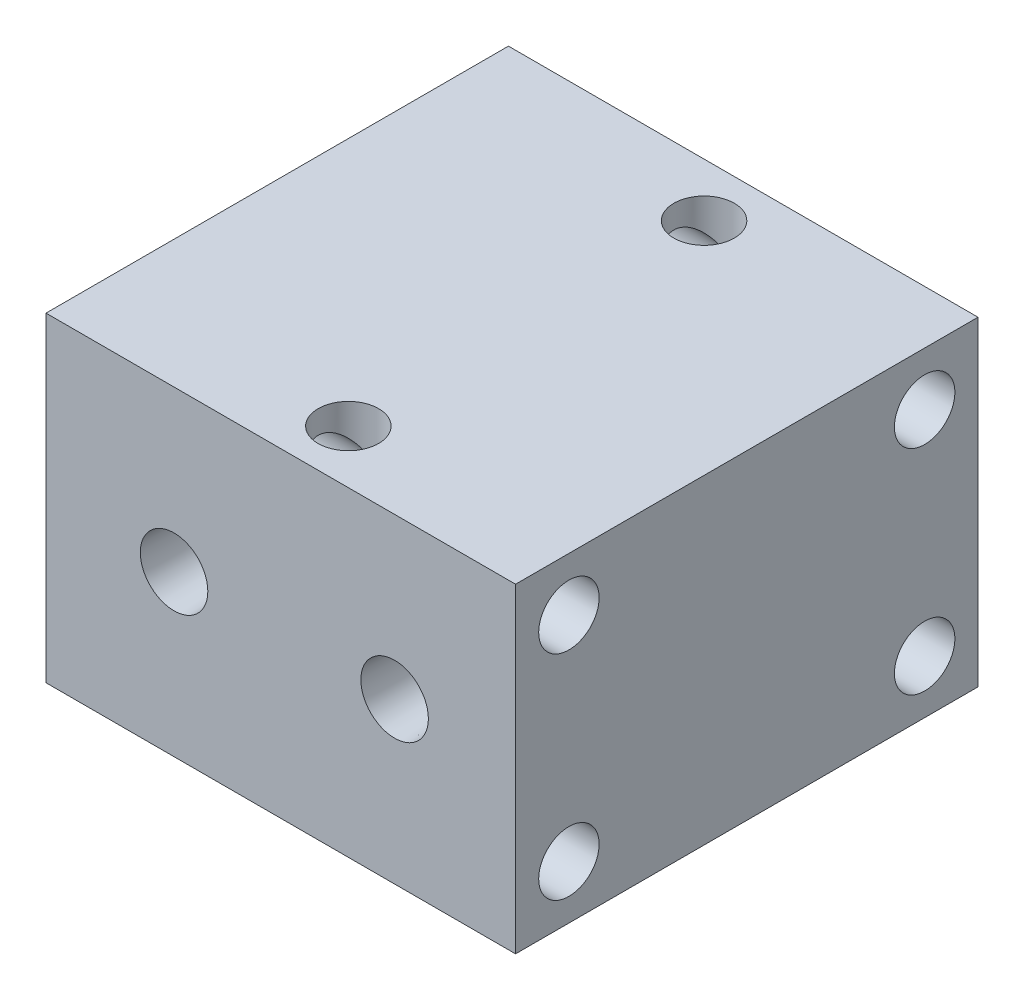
from build123d import *

# Parameters (mm, degrees)
SKETCH1_W                         = 66
SKETCH1_H                         = 65
SKETCH1_R                         = 4.25
EXTRUDE1_DEPTH                    = 45
SKETCH2_R                         = 0.5
CUT_EXTRUDE1_DEPTH                = 60
F_1_8_NPT_TAPPED_HOLE1_AT_2_COUNT = 2
F_1_8_NPT_TAPPED_HOLE1_AT_2_PITCH = 31
SKETCH5_R                         = 2
CUT_EXTRUDE2_DEPTH                = 20
CUT_EXTRUDE3_REACH                = 88.239
SKETCH6_R                         = 4.25


with BuildPart() as part:
    # Sketch1 → Extrude1 (new body)
    with BuildSketch(Plane(origin=(0, 0, 0), x_dir=(1, 0, 0), z_dir=(0, 1, 0))):
        Rectangle(SKETCH1_W, SKETCH1_H)
        with Locations(Location((2, 25, 0), (0, 0, 90))):
            Circle(SKETCH1_R, mode=Mode.SUBTRACT)
        with Locations(Location((2, -25, 0), (0, 0, 90))):
            Circle(SKETCH1_R, mode=Mode.SUBTRACT)
    extrude(amount=EXTRUDE1_DEPTH)

    # Sketch2 → Cut-Extrude1 (cut)
    with BuildSketch(Plane.ZY.offset(33)):
        with Locations((0, 22.5)):
            Circle(SKETCH2_R)
    extrude(amount=-CUT_EXTRUDE1_DEPTH, mode=Mode.SUBTRACT)

    # Sketch3 → 1_8 NPT Tapped Hole1 (revolve, cut)
    with BuildSketch(Plane(origin=(16, 22.5, 32.5), x_dir=(0, -1, 0), z_dir=(1, 0, 0))):
        Polygon((0, 0), (0, 14.153468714), (4.2164, 11.62), (4.2164, 6.92), (4.537398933, 6.92), (4.744593, 0), align=None)
    f_1_8_npt_tapped_hole1 = revolve(axis=Axis((16, 22.5, 38.85), (0, 0, -1)), mode=Mode.SUBTRACT)

    # 1_8 NPT Tapped Hole1 at 2: 1_8 NPT Tapped Hole1 ×2
    with Locations(*[(-i * F_1_8_NPT_TAPPED_HOLE1_AT_2_PITCH, 0, 0) for i in range(1, F_1_8_NPT_TAPPED_HOLE1_AT_2_COUNT)]):
        add(f_1_8_npt_tapped_hole1, mode=Mode.SUBTRACT)

    # Sketch5 → Cut-Extrude2 (cut)
    with BuildSketch(Plane.XY.offset(32.5)):
        with Locations((-15, 22.5)):
            Circle(SKETCH5_R)
        with Locations((16, 22.5)):
            Circle(SKETCH5_R)
    extrude(amount=-CUT_EXTRUDE2_DEPTH, mode=Mode.SUBTRACT)

    # Cut-Extrude3: up to this face of the body (flat: up to its plane)
    cut_extrude3_end = Plane(part.part.faces().sort_by_distance((33, 22.5, 0))[0])
    # Sketch6 → Cut-Extrude3 (cut, up to the picked face)
    with BuildSketch(Plane.ZY.offset(33), mode=Mode.PRIVATE) as cut_extrude3_sk1:
        with Locations((-25, 37.5)):
            Circle(SKETCH6_R)
    cut_extrude3_tool1 = split(extrude(cut_extrude3_sk1.sketch, amount=-CUT_EXTRUDE3_REACH, mode=Mode.PRIVATE), bisect_by=cut_extrude3_end, keep=Keep.BOTH, mode=Mode.PRIVATE)
    # Sketch6 → Cut-Extrude3 (cut, up to the picked face)
    with BuildSketch(Plane.ZY.offset(33), mode=Mode.PRIVATE) as cut_extrude3_sk2:
        with Locations((-25, 7.5)):
            Circle(SKETCH6_R)
    cut_extrude3_tool2 = split(extrude(cut_extrude3_sk2.sketch, amount=-CUT_EXTRUDE3_REACH, mode=Mode.PRIVATE), bisect_by=cut_extrude3_end, keep=Keep.BOTH, mode=Mode.PRIVATE)
    # Sketch6 → Cut-Extrude3 (cut, up to the picked face)
    with BuildSketch(Plane.ZY.offset(33), mode=Mode.PRIVATE) as cut_extrude3_sk3:
        with Locations((25, 37.5)):
            Circle(SKETCH6_R)
    cut_extrude3_tool3 = split(extrude(cut_extrude3_sk3.sketch, amount=-CUT_EXTRUDE3_REACH, mode=Mode.PRIVATE), bisect_by=cut_extrude3_end, keep=Keep.BOTH, mode=Mode.PRIVATE)
    # Sketch6 → Cut-Extrude3 (cut, up to the picked face)
    with BuildSketch(Plane.ZY.offset(33), mode=Mode.PRIVATE) as cut_extrude3_sk4:
        with Locations((25, 7.5)):
            Circle(SKETCH6_R)
    cut_extrude3_tool4 = split(extrude(cut_extrude3_sk4.sketch, amount=-CUT_EXTRUDE3_REACH, mode=Mode.PRIVATE), bisect_by=cut_extrude3_end, keep=Keep.BOTH, mode=Mode.PRIVATE)
    add(cut_extrude3_tool1.solids().sort_by(Axis((-33, 37.5, -25), (1, 0, 0)))[0], mode=Mode.SUBTRACT)
    add(cut_extrude3_tool2.solids().sort_by(Axis((-33, 7.5, -25), (1, 0, 0)))[0], mode=Mode.SUBTRACT)
    add(cut_extrude3_tool3.solids().sort_by(Axis((-33, 37.5, 25), (1, 0, 0)))[0], mode=Mode.SUBTRACT)
    add(cut_extrude3_tool4.solids().sort_by(Axis((-33, 7.5, 25), (1, 0, 0)))[0], mode=Mode.SUBTRACT)


solid = part.part
